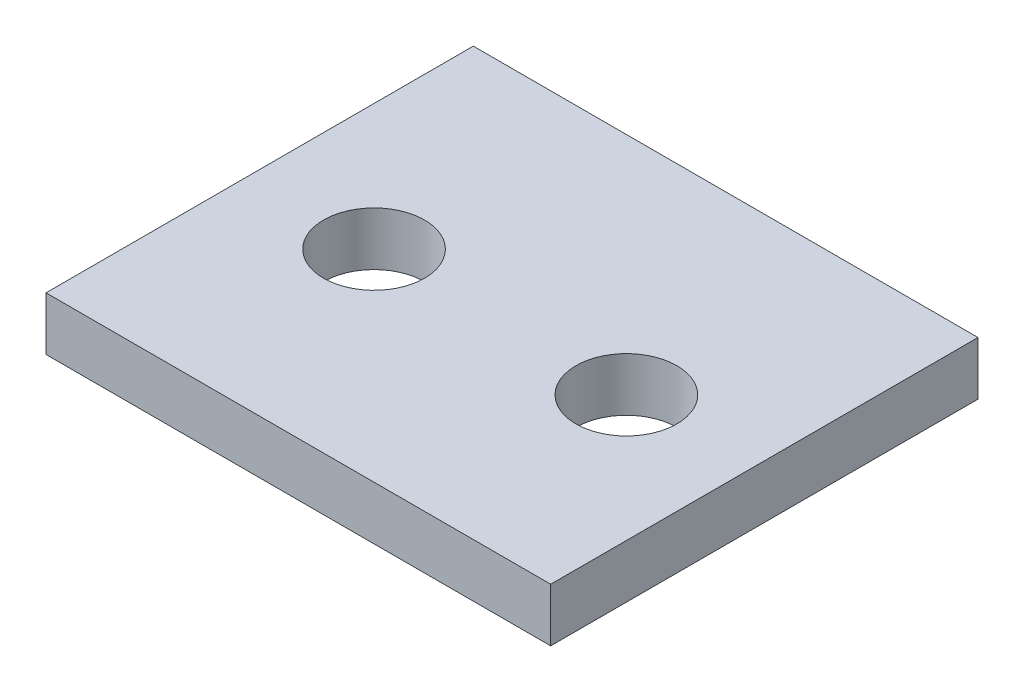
ISO-10303-21;
HEADER;
FILE_DESCRIPTION(('STEP AP214'),'2;1');
FILE_NAME('part.step','',(''),(''),'','','');
FILE_SCHEMA(('AUTOMOTIVE_DESIGN { 1 0 10303 214 1 1 1 1 }'));
ENDSEC;
DATA;
#1=APPLICATION_CONTEXT('core data for automotive mechanical design processes');
#2=APPLICATION_PROTOCOL_DEFINITION('international standard','automotive_design',2000,#1);
#3=PRODUCT_CONTEXT('',#1,'mechanical');
#4=PRODUCT('Part','Part','',(#3));
#5=PRODUCT_RELATED_PRODUCT_CATEGORY('part','',(#4));
#6=PRODUCT_DEFINITION_FORMATION('','',#4);
#7=PRODUCT_DEFINITION_CONTEXT('part definition',#1,'design');
#8=PRODUCT_DEFINITION('design','',#6,#7);
#9=PRODUCT_DEFINITION_SHAPE('','',#8);
#10=(LENGTH_UNIT() NAMED_UNIT(*) SI_UNIT(.MILLI.,.METRE.));
#11=(NAMED_UNIT(*) PLANE_ANGLE_UNIT() SI_UNIT($,.RADIAN.));
#12=(NAMED_UNIT(*) SI_UNIT($,.STERADIAN.) SOLID_ANGLE_UNIT());
#13=UNCERTAINTY_MEASURE_WITH_UNIT(LENGTH_MEASURE(1.E-05),#10,'distance_accuracy_value','');
#14=(GEOMETRIC_REPRESENTATION_CONTEXT(3) GLOBAL_UNCERTAINTY_ASSIGNED_CONTEXT((#13)) GLOBAL_UNIT_ASSIGNED_CONTEXT((#10,
#11,#12)) REPRESENTATION_CONTEXT('',''));
#15=CARTESIAN_POINT('',(0.,0.,0.));
#16=DIRECTION('',(0.,0.,1.));
#17=DIRECTION('',(1.,0.,0.));
#18=AXIS2_PLACEMENT_3D('',#15,#16,#17);
#19=CARTESIAN_POINT('',(15.,3.175,12.7));
#20=DIRECTION('',(0.,1.,0.));
#21=DIRECTION('',(0.,0.,1.));
#22=AXIS2_PLACEMENT_3D('',#19,#20,#21);
#23=PLANE('',#22);
#24=CARTESIAN_POINT('',(-7.50000000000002,3.175,0.699999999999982));
#25=DIRECTION('',(0.,1.,0.));
#26=DIRECTION('',(0.,0.,1.));
#27=AXIS2_PLACEMENT_3D('',#24,#25,#26);
#28=CIRCLE('',#27,3.);
#29=CARTESIAN_POINT('',(-7.50000000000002,3.175,3.69999999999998));
#30=VERTEX_POINT('',#29);
#31=EDGE_CURVE('E99',#30,#30,#28,.T.);
#32=ORIENTED_EDGE('',*,*,#31,.F.);
#33=EDGE_LOOP('',(#32));
#34=FACE_BOUND('',#33,.T.);
#35=DIRECTION('',(0.,0.,-1.));
#36=VECTOR('',#35,1.);
#37=CARTESIAN_POINT('',(15.,3.175,-12.7));
#38=LINE('',#37,#36);
#39=CARTESIAN_POINT('',(15.,3.175,12.7));
#40=VERTEX_POINT('',#39);
#41=CARTESIAN_POINT('',(15.,3.175,-12.7));
#42=VERTEX_POINT('',#41);
#43=EDGE_CURVE('E84',#40,#42,#38,.T.);
#44=ORIENTED_EDGE('',*,*,#43,.T.);
#45=DIRECTION('',(-1.,0.,0.));
#46=VECTOR('',#45,1.);
#47=CARTESIAN_POINT('',(-15.,3.175,-12.7));
#48=LINE('',#47,#46);
#49=CARTESIAN_POINT('',(-15.,3.175,-12.7));
#50=VERTEX_POINT('',#49);
#51=EDGE_CURVE('E79',#42,#50,#48,.T.);
#52=ORIENTED_EDGE('',*,*,#51,.T.);
#53=DIRECTION('',(0.,0.,1.));
#54=VECTOR('',#53,1.);
#55=CARTESIAN_POINT('',(-15.,3.175,-12.7));
#56=LINE('',#55,#54);
#57=CARTESIAN_POINT('',(-15.,3.175,12.7));
#58=VERTEX_POINT('',#57);
#59=EDGE_CURVE('E82',#50,#58,#56,.T.);
#60=ORIENTED_EDGE('',*,*,#59,.T.);
#61=DIRECTION('',(1.,0.,0.));
#62=VECTOR('',#61,1.);
#63=CARTESIAN_POINT('',(-15.,3.175,12.7));
#64=LINE('',#63,#62);
#65=EDGE_CURVE('E49',#58,#40,#64,.T.);
#66=ORIENTED_EDGE('',*,*,#65,.T.);
#67=EDGE_LOOP('',(#44,#52,#60,#66));
#68=FACE_BOUND('',#67,.T.);
#69=CARTESIAN_POINT('',(7.49999999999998,3.175,0.699999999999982));
#70=DIRECTION('',(0.,1.,0.));
#71=DIRECTION('',(0.,0.,-1.));
#72=AXIS2_PLACEMENT_3D('',#69,#70,#71);
#73=CIRCLE('',#72,3.);
#74=CARTESIAN_POINT('',(7.49999999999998,3.175,-2.30000000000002));
#75=VERTEX_POINT('',#74);
#76=EDGE_CURVE('E114',#75,#75,#73,.T.);
#77=ORIENTED_EDGE('',*,*,#76,.F.);
#78=EDGE_LOOP('',(#77));
#79=FACE_BOUND('',#78,.T.);
#80=ADVANCED_FACE('F32',(#34,#68,#79),#23,.T.);
#81=CARTESIAN_POINT('',(15.,0.,12.7));
#82=DIRECTION('',(0.,1.,0.));
#83=DIRECTION('',(0.,0.,1.));
#84=AXIS2_PLACEMENT_3D('',#81,#82,#83);
#85=PLANE('',#84);
#86=CARTESIAN_POINT('',(-7.50000000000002,0.,0.699999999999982));
#87=DIRECTION('',(0.,1.,0.));
#88=DIRECTION('',(0.,0.,1.));
#89=AXIS2_PLACEMENT_3D('',#86,#87,#88);
#90=CIRCLE('',#89,3.);
#91=CARTESIAN_POINT('',(-7.50000000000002,0.,3.69999999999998));
#92=VERTEX_POINT('',#91);
#93=EDGE_CURVE('E111',#92,#92,#90,.T.);
#94=ORIENTED_EDGE('',*,*,#93,.T.);
#95=EDGE_LOOP('',(#94));
#96=FACE_BOUND('',#95,.T.);
#97=DIRECTION('',(0.,0.,-1.));
#98=VECTOR('',#97,1.);
#99=CARTESIAN_POINT('',(15.,0.,-12.7));
#100=LINE('',#99,#98);
#101=CARTESIAN_POINT('',(15.,0.,12.7));
#102=VERTEX_POINT('',#101);
#103=CARTESIAN_POINT('',(15.,0.,-12.7));
#104=VERTEX_POINT('',#103);
#105=EDGE_CURVE('E96',#102,#104,#100,.T.);
#106=ORIENTED_EDGE('',*,*,#105,.F.);
#107=DIRECTION('',(1.,0.,0.));
#108=VECTOR('',#107,1.);
#109=CARTESIAN_POINT('',(-15.,0.,12.7));
#110=LINE('',#109,#108);
#111=CARTESIAN_POINT('',(-15.,0.,12.7));
#112=VERTEX_POINT('',#111);
#113=EDGE_CURVE('E72',#112,#102,#110,.T.);
#114=ORIENTED_EDGE('',*,*,#113,.F.);
#115=DIRECTION('',(0.,0.,1.));
#116=VECTOR('',#115,1.);
#117=CARTESIAN_POINT('',(-15.,0.,-12.7));
#118=LINE('',#117,#116);
#119=CARTESIAN_POINT('',(-15.,0.,-12.7));
#120=VERTEX_POINT('',#119);
#121=EDGE_CURVE('E66',#120,#112,#118,.T.);
#122=ORIENTED_EDGE('',*,*,#121,.F.);
#123=DIRECTION('',(-1.,0.,0.));
#124=VECTOR('',#123,1.);
#125=CARTESIAN_POINT('',(-15.,0.,-12.7));
#126=LINE('',#125,#124);
#127=EDGE_CURVE('E88',#104,#120,#126,.T.);
#128=ORIENTED_EDGE('',*,*,#127,.F.);
#129=EDGE_LOOP('',(#106,#114,#122,#128));
#130=FACE_BOUND('',#129,.T.);
#131=CARTESIAN_POINT('',(7.49999999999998,0.,0.699999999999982));
#132=DIRECTION('',(0.,1.,0.));
#133=DIRECTION('',(0.,0.,-1.));
#134=AXIS2_PLACEMENT_3D('',#131,#132,#133);
#135=CIRCLE('',#134,3.);
#136=CARTESIAN_POINT('',(7.49999999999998,0.,-2.30000000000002));
#137=VERTEX_POINT('',#136);
#138=EDGE_CURVE('E117',#137,#137,#135,.T.);
#139=ORIENTED_EDGE('',*,*,#138,.T.);
#140=EDGE_LOOP('',(#139));
#141=FACE_BOUND('',#140,.T.);
#142=ADVANCED_FACE('F107',(#96,#130,#141),#85,.F.);
#143=CARTESIAN_POINT('',(15.,3.175,-12.7));
#144=DIRECTION('',(-1.,0.,0.));
#145=DIRECTION('',(0.,0.,1.));
#146=AXIS2_PLACEMENT_3D('',#143,#144,#145);
#147=PLANE('',#146);
#148=ORIENTED_EDGE('',*,*,#105,.T.);
#149=DIRECTION('',(0.,-1.,0.));
#150=VECTOR('',#149,1.);
#151=CARTESIAN_POINT('',(15.,3.175,-12.7));
#152=LINE('',#151,#150);
#153=EDGE_CURVE('E11',#42,#104,#152,.T.);
#154=ORIENTED_EDGE('',*,*,#153,.F.);
#155=ORIENTED_EDGE('',*,*,#43,.F.);
#156=DIRECTION('',(0.,-1.,0.));
#157=VECTOR('',#156,1.);
#158=CARTESIAN_POINT('',(15.,3.175,12.7));
#159=LINE('',#158,#157);
#160=EDGE_CURVE('E92',#40,#102,#159,.T.);
#161=ORIENTED_EDGE('',*,*,#160,.T.);
#162=EDGE_LOOP('',(#148,#154,#155,#161));
#163=FACE_BOUND('',#162,.T.);
#164=ADVANCED_FACE('F34',(#163),#147,.F.);
#165=CARTESIAN_POINT('',(-15.,3.175,-12.7));
#166=DIRECTION('',(0.,0.,1.));
#167=DIRECTION('',(1.,0.,0.));
#168=AXIS2_PLACEMENT_3D('',#165,#166,#167);
#169=PLANE('',#168);
#170=ORIENTED_EDGE('',*,*,#127,.T.);
#171=DIRECTION('',(0.,-1.,0.));
#172=VECTOR('',#171,1.);
#173=CARTESIAN_POINT('',(-15.,3.175,-12.7));
#174=LINE('',#173,#172);
#175=EDGE_CURVE('E41',#50,#120,#174,.T.);
#176=ORIENTED_EDGE('',*,*,#175,.F.);
#177=ORIENTED_EDGE('',*,*,#51,.F.);
#178=ORIENTED_EDGE('',*,*,#153,.T.);
#179=EDGE_LOOP('',(#170,#176,#177,#178));
#180=FACE_BOUND('',#179,.T.);
#181=ADVANCED_FACE('F87',(#180),#169,.F.);
#182=CARTESIAN_POINT('',(-15.,3.175,-12.7));
#183=DIRECTION('',(1.,0.,0.));
#184=DIRECTION('',(0.,0.,-1.));
#185=AXIS2_PLACEMENT_3D('',#182,#183,#184);
#186=PLANE('',#185);
#187=ORIENTED_EDGE('',*,*,#121,.T.);
#188=DIRECTION('',(0.,-1.,0.));
#189=VECTOR('',#188,1.);
#190=CARTESIAN_POINT('',(-15.,3.175,12.7));
#191=LINE('',#190,#189);
#192=EDGE_CURVE('E89',#58,#112,#191,.T.);
#193=ORIENTED_EDGE('',*,*,#192,.F.);
#194=ORIENTED_EDGE('',*,*,#59,.F.);
#195=ORIENTED_EDGE('',*,*,#175,.T.);
#196=EDGE_LOOP('',(#187,#193,#194,#195));
#197=FACE_BOUND('',#196,.T.);
#198=ADVANCED_FACE('F90',(#197),#186,.F.);
#199=CARTESIAN_POINT('',(-15.,3.175,12.7));
#200=DIRECTION('',(0.,0.,-1.));
#201=DIRECTION('',(-1.,0.,0.));
#202=AXIS2_PLACEMENT_3D('',#199,#200,#201);
#203=PLANE('',#202);
#204=ORIENTED_EDGE('',*,*,#113,.T.);
#205=ORIENTED_EDGE('',*,*,#160,.F.);
#206=ORIENTED_EDGE('',*,*,#65,.F.);
#207=ORIENTED_EDGE('',*,*,#192,.T.);
#208=EDGE_LOOP('',(#204,#205,#206,#207));
#209=FACE_BOUND('',#208,.T.);
#210=ADVANCED_FACE('F104',(#209),#203,.F.);
#211=CARTESIAN_POINT('',(-7.50000000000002,3.175,0.699999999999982));
#212=DIRECTION('',(0.,-1.,0.));
#213=DIRECTION('',(0.,0.,-1.));
#214=AXIS2_PLACEMENT_3D('',#211,#212,#213);
#215=CYLINDRICAL_SURFACE('',#214,3.);
#216=ORIENTED_EDGE('',*,*,#31,.T.);
#217=EDGE_LOOP('',(#216));
#218=FACE_BOUND('',#217,.T.);
#219=ORIENTED_EDGE('',*,*,#93,.F.);
#220=EDGE_LOOP('',(#219));
#221=FACE_BOUND('',#220,.T.);
#222=ADVANCED_FACE('F135',(#218,#221),#215,.F.);
#223=CARTESIAN_POINT('',(7.49999999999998,3.175,0.699999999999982));
#224=DIRECTION('',(0.,-1.,0.));
#225=DIRECTION('',(0.,0.,-1.));
#226=AXIS2_PLACEMENT_3D('',#223,#224,#225);
#227=CYLINDRICAL_SURFACE('',#226,3.);
#228=ORIENTED_EDGE('',*,*,#76,.T.);
#229=EDGE_LOOP('',(#228));
#230=FACE_BOUND('',#229,.T.);
#231=ORIENTED_EDGE('',*,*,#138,.F.);
#232=EDGE_LOOP('',(#231));
#233=FACE_BOUND('',#232,.T.);
#234=ADVANCED_FACE('F123',(#230,#233),#227,.F.);
#235=CLOSED_SHELL('',(#80,#142,#164,#181,#198,#210,#222,#234));
#236=MANIFOLD_SOLID_BREP('B2',#235);
#237=ADVANCED_BREP_SHAPE_REPRESENTATION('',(#18,#236),#14);
#238=SHAPE_DEFINITION_REPRESENTATION(#9,#237);
ENDSEC;
END-ISO-10303-21;
